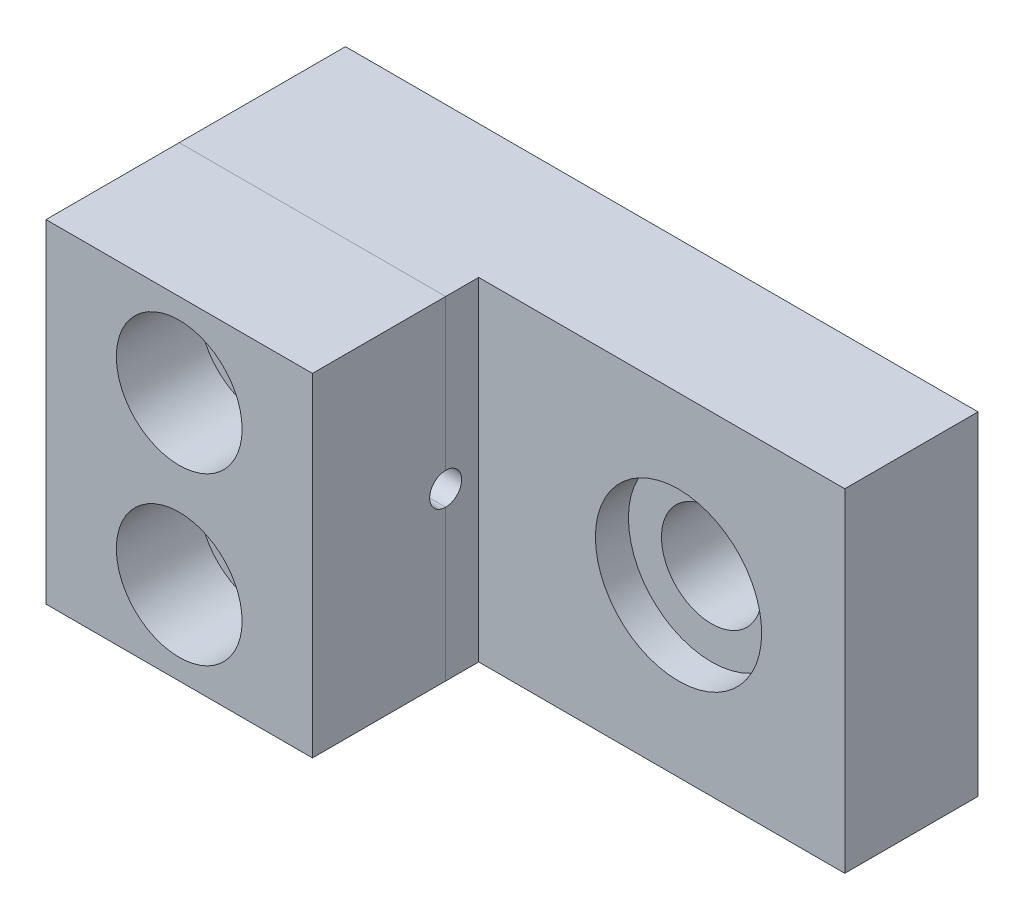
from build123d import *

# Parameters (mm, degrees)
SKETCH2_W           = 30.1498
SKETCH2_H           = 15.875
SKETCH2_R           = 2.3876
SKETCH2_R_2         = 1.7272
BOSS_EXTRUDE1_DEPTH = 6.35
SKETCH3_W           = 12.7
SKETCH3_H           = 15.875
SKETCH3_R           = 1.7272
BOSS_EXTRUDE2_DEPTH = 7.9248
SKETCH4_W           = 12.7
SKETCH4_H           = 15.875
SKETCH4_R           = 1.7272
BOSS_EXTRUDE3_DEPTH = 6.35
SKETCH5_R           = 0.762
CUT_EXTRUDE1_DEPTH  = 14.605
SKETCH6_R           = 2.9972
CUT_EXTRUDE2_DEPTH  = 3.9624
SKETCH7_R           = 3.9624
CUT_EXTRUDE3_DEPTH  = 1.5748


with BuildPart() as part:
    # Sketch2 → Boss-Extrude1 (new body)
    with BuildSketch(Plane.XY):
        with Locations((-7.1501, 0)):
            Rectangle(SKETCH2_W, SKETCH2_H)
        Circle(SKETCH2_R, mode=Mode.SUBTRACT)
        with Locations((-15.875, -3.9624)):
            Circle(SKETCH2_R_2, mode=Mode.SUBTRACT)
        with Locations((-15.875, 3.9624)):
            Circle(SKETCH2_R_2, mode=Mode.SUBTRACT)
    extrude(amount=BOSS_EXTRUDE1_DEPTH)

    # Sketch3 → Boss-Extrude2 (add)
    with BuildSketch(Plane.XY):
        with Locations((-15.875, 0)):
            Rectangle(SKETCH3_W, SKETCH3_H)
        with Locations((-15.875, -3.9624)):
            Circle(SKETCH3_R, mode=Mode.SUBTRACT)
        with Locations((-15.875, 3.9624)):
            Circle(SKETCH3_R, mode=Mode.SUBTRACT)
    extrude(amount=BOSS_EXTRUDE2_DEPTH)


with BuildPart() as body_2:
    # Sketch4 → Boss-Extrude3 (new body)
    with BuildSketch(Plane.XY.offset(7.9248)):
        with Locations((-15.875, 0)):
            Rectangle(SKETCH4_W, SKETCH4_H)
        with Locations((-15.875, -3.9624)):
            Circle(SKETCH4_R, mode=Mode.SUBTRACT)
        with Locations((-15.875, 3.9624)):
            Circle(SKETCH4_R, mode=Mode.SUBTRACT)
    extrude(amount=BOSS_EXTRUDE3_DEPTH)


with BuildPart() as cut_extrude1_tool:
    # Sketch5 → Cut-Extrude1 (new body)
    with BuildSketch(Plane.ZY.offset(22.225)):
        with Locations((7.9248, 0)):
            Circle(SKETCH5_R)
    extrude(amount=-CUT_EXTRUDE1_DEPTH)


with BuildPart() as part_1:
    add(part.part)

    # Cut-Extrude1: cut by cut_extrude1_tool
    add(cut_extrude1_tool.part, mode=Mode.SUBTRACT)

    # Sketch7 → Cut-Extrude3 (cut)
    with BuildSketch(Plane.XY.offset(6.35)):
        Circle(SKETCH7_R)
    extrude(amount=-CUT_EXTRUDE3_DEPTH, mode=Mode.SUBTRACT)


with BuildPart() as body_2_1:
    add(body_2.part)

    # Cut-Extrude1: cut by cut_extrude1_tool
    add(cut_extrude1_tool.part, mode=Mode.SUBTRACT)

    # Sketch6 → Cut-Extrude2 (cut)
    with BuildSketch(Plane.XY.offset(14.2748)):
        with Locations((-15.875, 3.9624)):
            Circle(SKETCH6_R)
        with Locations((-15.875, -3.9624)):
            Circle(SKETCH6_R)
    extrude(amount=-CUT_EXTRUDE2_DEPTH, mode=Mode.SUBTRACT)


solid = Compound([part_1.part, body_2_1.part])
